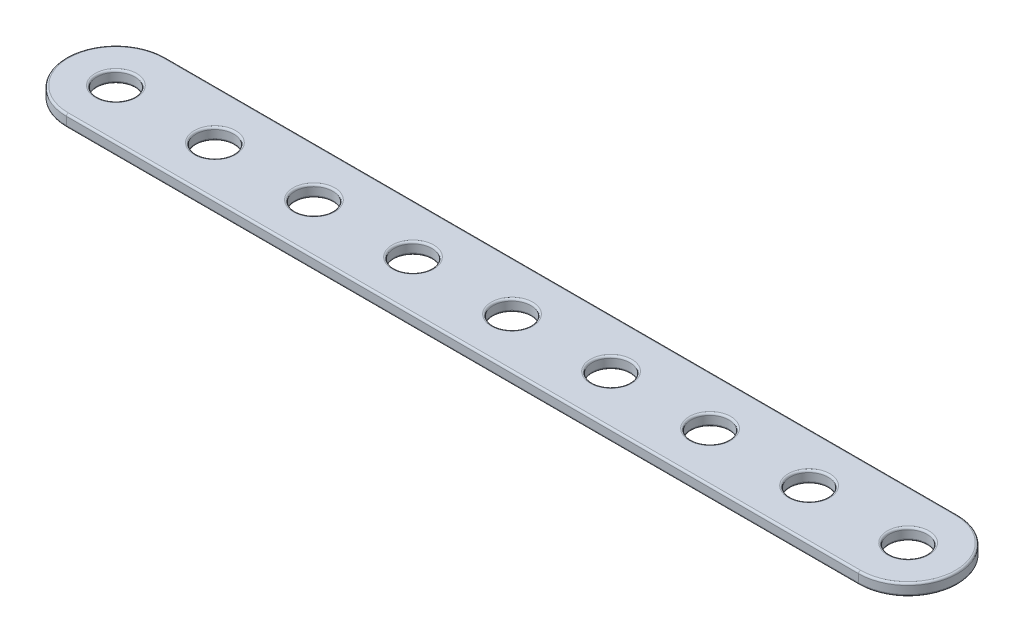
from build123d import *

# Parameters (mm, degrees)
EXTRUDE1_DEPTH     = 1.524
SKETCH2_R          = 2.413
CUT_EXTRUDE1_DEPTH = 109.705175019
LPATTERN1_COUNT    = 9
LPATTERN1_PITCH    = 12.7
FILLET1_R          = 0.254


with BuildPart() as part:
    # Sketch1 → Extrude1 (new body)
    with BuildSketch(Plane(origin=(0, 0, 0), x_dir=(1, 0, 0), z_dir=(0, 1, 0))):
        with BuildLine():
            Line((0, 0), (101.6, 0))
            ThreePointArc((101.6, 0), (107.95, 6.35), (101.6, 12.7))
            Line((101.6, 12.7), (0, 12.7))
            ThreePointArc((0, 12.7), (-6.35, 6.35), (0, 0))
        make_face()
    extrude(amount=EXTRUDE1_DEPTH)

    # Sketch2 → Cut-Extrude1 (cut, through all)
    with BuildSketch(Plane(origin=(0, 1.524, 0), x_dir=(-1, 0, 0), z_dir=(0, 1, 0))):
        with Locations(Location((0, -6.35, 0), (0, 0, 90))):
            Circle(SKETCH2_R)
    cut_extrude1 = extrude(amount=-CUT_EXTRUDE1_DEPTH, mode=Mode.SUBTRACT)

    # LPattern1: Cut-Extrude1 ×9
    with Locations(*[(i * LPATTERN1_PITCH, 0, 0) for i in range(1, LPATTERN1_COUNT)]):
        add(cut_extrude1, mode=Mode.SUBTRACT)

    # Fillet1
    fillet1_edges = [part.edges().sort_by_distance(p)[0] for p in [
        (107.95, 1.524, -6.35),
        (50.8, 1.524, -12.7),
        (0, 0, -8.763),
        (0, 1.524, -8.763),
        (12.7, 0, -8.763),
        (12.7, 1.524, -8.763),
        (25.4, 0, -8.763),
        (25.4, 1.524, -8.763),
        (38.1, 0, -8.763),
        (38.1, 1.524, -8.763),
        (50.8, 0, -8.763),
        (50.8, 1.524, -8.763),
        (63.5, 0, -8.763),
        (63.5, 1.524, -8.763),
        (76.2, 0, -8.763),
        (76.2, 1.524, -8.763),
        (-6.35, 1.524, -6.35),
        (50.8, 0, -12.7),
        (88.9, 0, -8.763),
        (88.9, 1.524, -8.763),
        (107.95, 0, -6.35),
        (101.6, 0, -8.763),
        (101.6, 1.524, -8.763),
        (50.8, 0, 0),
        (-6.35, 0, -6.35),
        (50.8, 1.524, 0),
    ]]
    fillet(fillet1_edges, radius=FILLET1_R)


solid = part.part
